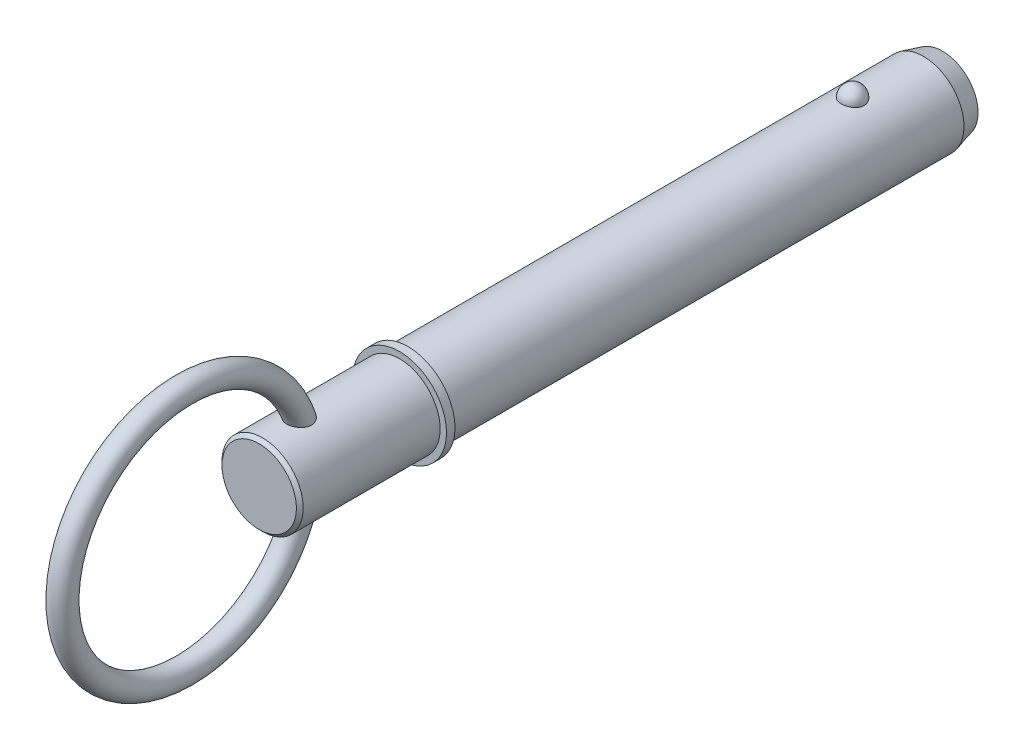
ISO-10303-21;
HEADER;
FILE_DESCRIPTION(('STEP AP214'),'2;1');
FILE_NAME('part.step','',(''),(''),'','','');
FILE_SCHEMA(('AUTOMOTIVE_DESIGN { 1 0 10303 214 1 1 1 1 }'));
ENDSEC;
DATA;
#1=APPLICATION_CONTEXT('core data for automotive mechanical design processes');
#2=APPLICATION_PROTOCOL_DEFINITION('international standard','automotive_design',2000,#1);
#3=PRODUCT_CONTEXT('',#1,'mechanical');
#4=PRODUCT('Part','Part','',(#3));
#5=PRODUCT_RELATED_PRODUCT_CATEGORY('part','',(#4));
#6=PRODUCT_DEFINITION_FORMATION('','',#4);
#7=PRODUCT_DEFINITION_CONTEXT('part definition',#1,'design');
#8=PRODUCT_DEFINITION('design','',#6,#7);
#9=PRODUCT_DEFINITION_SHAPE('','',#8);
#10=(LENGTH_UNIT() NAMED_UNIT(*) SI_UNIT(.MILLI.,.METRE.));
#11=(NAMED_UNIT(*) PLANE_ANGLE_UNIT() SI_UNIT($,.RADIAN.));
#12=(NAMED_UNIT(*) SI_UNIT($,.STERADIAN.) SOLID_ANGLE_UNIT());
#13=UNCERTAINTY_MEASURE_WITH_UNIT(LENGTH_MEASURE(1.E-05),#10,'distance_accuracy_value','');
#14=(GEOMETRIC_REPRESENTATION_CONTEXT(3) GLOBAL_UNCERTAINTY_ASSIGNED_CONTEXT((#13)) GLOBAL_UNIT_ASSIGNED_CONTEXT((#10,
#11,#12)) REPRESENTATION_CONTEXT('',''));
#15=CARTESIAN_POINT('',(0.,0.,0.));
#16=DIRECTION('',(0.,0.,1.));
#17=DIRECTION('',(1.,0.,0.));
#18=AXIS2_PLACEMENT_3D('',#15,#16,#17);
#19=CARTESIAN_POINT('',(0.,0.,101.6));
#20=DIRECTION('',(0.,0.,-1.));
#21=DIRECTION('',(-1.,0.,0.));
#22=AXIS2_PLACEMENT_3D('',#19,#20,#21);
#23=CYLINDRICAL_SURFACE('',#22,9.525);
#24=CARTESIAN_POINT('',(2.66304631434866,9.14515223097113,-2.69));
#25=CARTESIAN_POINT('',(2.66304388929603,9.14515434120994,-2.53964785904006));
#26=CARTESIAN_POINT('',(2.65079171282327,9.14874785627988,-2.389265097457));
#27=CARTESIAN_POINT('',(2.60207590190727,9.16272073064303,-2.09276319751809));
#28=CARTESIAN_POINT('',(2.5656035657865,9.17310252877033,-1.94664561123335));
#29=CARTESIAN_POINT('',(2.469373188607,9.19947238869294,-1.66290124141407));
#30=CARTESIAN_POINT('',(2.40962536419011,9.215457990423,-1.52527076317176));
#31=CARTESIAN_POINT('',(2.26832639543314,9.25124900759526,-1.26225231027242));
#32=CARTESIAN_POINT('',(2.1867756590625,9.27105435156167,-1.13686410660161));
#33=CARTESIAN_POINT('',(2.00344089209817,9.3123948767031,-0.901158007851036));
#34=CARTESIAN_POINT('',(1.90155748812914,9.33393823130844,-0.790918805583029));
#35=CARTESIAN_POINT('',(1.68043702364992,9.37626794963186,-0.589299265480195));
#36=CARTESIAN_POINT('',(1.56119995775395,9.397054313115,-0.497918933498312));
#37=CARTESIAN_POINT('',(1.30893044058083,9.43549335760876,-0.336812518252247));
#38=CARTESIAN_POINT('',(1.17593917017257,9.45315498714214,-0.26702415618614));
#39=CARTESIAN_POINT('',(0.8995966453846,9.48344056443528,-0.150749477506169));
#40=CARTESIAN_POINT('',(0.756246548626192,9.49606507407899,-0.104260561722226));
#41=CARTESIAN_POINT('',(0.466048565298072,9.51468193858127,-0.036573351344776));
#42=CARTESIAN_POINT('',(0.319312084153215,9.52079100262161,-0.0149294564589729));
#43=CARTESIAN_POINT('',(0.0241592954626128,9.52611235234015,0.00395337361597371));
#44=CARTESIAN_POINT('',(-0.124256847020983,9.5253253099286,0.0011946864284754));
#45=CARTESIAN_POINT('',(-0.41628168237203,9.51700443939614,-0.0284230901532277));
#46=CARTESIAN_POINT('',(-0.559928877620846,9.50956858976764,-0.0549321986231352));
#47=CARTESIAN_POINT('',(-0.840604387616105,9.48887888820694,-0.130816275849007));
#48=CARTESIAN_POINT('',(-0.977632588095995,9.47562493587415,-0.180191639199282));
#49=CARTESIAN_POINT('',(-1.24212223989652,9.44460733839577,-0.300803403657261));
#50=CARTESIAN_POINT('',(-1.36952298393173,9.42681774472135,-0.372166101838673));
#51=CARTESIAN_POINT('',(-1.61053183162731,9.38864858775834,-0.534729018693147));
#52=CARTESIAN_POINT('',(-1.72413851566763,9.36826875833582,-0.625931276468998));
#53=CARTESIAN_POINT('',(-1.9367483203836,9.32666137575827,-0.827716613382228));
#54=CARTESIAN_POINT('',(-2.03542624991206,9.3054250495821,-0.938640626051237));
#55=CARTESIAN_POINT('',(-2.21301001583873,9.26480083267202,-1.17562728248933));
#56=CARTESIAN_POINT('',(-2.29191442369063,9.24541307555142,-1.30169101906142));
#57=CARTESIAN_POINT('',(-2.4288038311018,9.21040769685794,-1.56709947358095));
#58=CARTESIAN_POINT('',(-2.48653332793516,9.19483682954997,-1.70658229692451));
#59=CARTESIAN_POINT('',(-2.57830950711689,9.16952722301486,-1.99363485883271));
#60=CARTESIAN_POINT('',(-2.61235688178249,9.1597883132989,-2.14120436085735));
#61=CARTESIAN_POINT('',(-2.65582131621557,9.14728131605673,-2.43957517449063));
#62=CARTESIAN_POINT('',(-2.66534248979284,9.14448376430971,-2.59036007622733));
#63=CARTESIAN_POINT('',(-2.659816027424,9.1460926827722,-2.89143694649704));
#64=CARTESIAN_POINT('',(-2.64476907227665,9.15049895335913,-3.04172892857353));
#65=CARTESIAN_POINT('',(-2.59062526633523,9.16597303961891,-3.33676161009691));
#66=CARTESIAN_POINT('',(-2.55165119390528,9.17700684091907,-3.48152666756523));
#67=CARTESIAN_POINT('',(-2.45072334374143,9.20447158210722,-3.76226728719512));
#68=CARTESIAN_POINT('',(-2.38876863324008,9.22090274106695,-3.89824249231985));
#69=CARTESIAN_POINT('',(-2.24300082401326,9.25744165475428,-4.15838266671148));
#70=CARTESIAN_POINT('',(-2.15906901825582,9.27756919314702,-4.28247834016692));
#71=CARTESIAN_POINT('',(-1.97161008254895,9.31920445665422,-4.51460755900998));
#72=CARTESIAN_POINT('',(-1.86808218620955,9.34071223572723,-4.62264047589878));
#73=CARTESIAN_POINT('',(-1.64365852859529,9.38280712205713,-4.8200541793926));
#74=CARTESIAN_POINT('',(-1.52269814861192,9.40339041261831,-4.90936239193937));
#75=CARTESIAN_POINT('',(-1.26696810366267,9.44124442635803,-5.06628635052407));
#76=CARTESIAN_POINT('',(-1.13219941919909,9.45851538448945,-5.13390363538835));
#77=CARTESIAN_POINT('',(-0.854427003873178,9.48761400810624,-5.24478918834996));
#78=CARTESIAN_POINT('',(-0.711548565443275,9.49950757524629,-5.28835378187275));
#79=CARTESIAN_POINT('',(-0.420167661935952,9.51684639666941,-5.35116010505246));
#80=CARTESIAN_POINT('',(-0.271665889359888,9.52229244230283,-5.37040481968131));
#81=CARTESIAN_POINT('',(0.0236961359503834,9.52609381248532,-5.38387805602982));
#82=CARTESIAN_POINT('',(0.170533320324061,9.52458300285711,-5.37857884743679));
#83=CARTESIAN_POINT('',(0.461166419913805,9.51494050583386,-5.34419624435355));
#84=CARTESIAN_POINT('',(0.604962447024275,9.50680906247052,-5.31511372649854));
#85=CARTESIAN_POINT('',(0.884899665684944,9.48484202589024,-5.23415185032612));
#86=CARTESIAN_POINT('',(1.02106863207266,9.47102889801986,-5.18236222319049));
#87=CARTESIAN_POINT('',(1.28268503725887,9.43915933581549,-5.05742910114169));
#88=CARTESIAN_POINT('',(1.40813178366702,9.421102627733,-4.98428422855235));
#89=CARTESIAN_POINT('',(1.64690915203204,9.38233399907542,-4.81729201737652));
#90=CARTESIAN_POINT('',(1.76002050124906,9.36158508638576,-4.72313982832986));
#91=CARTESIAN_POINT('',(1.96897358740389,9.31987907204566,-4.5173244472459));
#92=CARTESIAN_POINT('',(2.06481234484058,9.29892193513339,-4.40565824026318));
#93=CARTESIAN_POINT('',(2.23837433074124,9.25869342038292,-4.16566572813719));
#94=CARTESIAN_POINT('',(2.31574652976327,9.23945848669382,-4.03707931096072));
#95=CARTESIAN_POINT('',(2.44818540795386,9.20525491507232,-3.76840633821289));
#96=CARTESIAN_POINT('',(2.50325979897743,9.19028480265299,-3.62832377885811));
#97=CARTESIAN_POINT('',(2.58510224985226,9.16757716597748,-3.35610038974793));
#98=CARTESIAN_POINT('',(2.61427951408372,9.15923447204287,-3.22472833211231));
#99=CARTESIAN_POINT('',(2.6532524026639,9.14802112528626,-2.95891229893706));
#100=CARTESIAN_POINT('',(2.66304848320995,9.1451503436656,-2.82446839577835));
#101=CARTESIAN_POINT('',(2.66304631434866,9.14515223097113,-2.69));
#102=B_SPLINE_CURVE_WITH_KNOTS('',3,(#24,#25,#26,#27,#28,#29,#30,#31,#32,#33,#34,#35,#36,#37,
#38,#39,#40,#41,#42,#43,#44,#45,#46,#47,#48,#49,#50,#51,#52,#53,#54,#55,#56,#57,#58,#59,#60,#61,
#62,#63,#64,#65,#66,#67,#68,#69,#70,#71,#72,#73,#74,#75,#76,#77,#78,#79,#80,#81,#82,#83,#84,#85,
#86,#87,#88,#89,#90,#91,#92,#93,#94,#95,#96,#97,#98,#99,#100,#101),.UNSPECIFIED.,.T.,.F.,(4,2,2,
2,2,2,2,2,2,2,2,2,2,2,2,2,2,2,2,2,2,2,2,2,2,2,2,2,2,2,2,2,2,2,2,2,2,2,4),(0.,0.450573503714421,
0.901308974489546,1.35184682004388,1.80237623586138,2.25516399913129,2.70795190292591,
3.15942136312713,3.61084044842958,4.0540301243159,4.49717661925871,4.9338984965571,
5.37062791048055,5.80991423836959,6.24924573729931,6.69708004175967,7.1449466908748,
7.5980522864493,8.0511446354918,8.50231041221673,8.95346368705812,9.40232106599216,
9.85119666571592,10.3025487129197,10.7539184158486,11.2070064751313,11.6600623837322,
12.1074045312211,12.5546917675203,12.9934085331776,13.4321091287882,13.8690915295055,
14.3061021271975,14.7499227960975,15.1938199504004,15.6455814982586,16.0971866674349,
16.5001694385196,16.9031427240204),.UNSPECIFIED.);
#103=CARTESIAN_POINT('',(2.66304631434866,9.14515223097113,-2.69));
#104=VERTEX_POINT('',#103);
#105=EDGE_CURVE('E103',#104,#104,#102,.T.);
#106=ORIENTED_EDGE('',*,*,#105,.T.);
#107=EDGE_LOOP('',(#106));
#108=FACE_BOUND('',#107,.T.);
#109=CARTESIAN_POINT('',(0.,0.,-19.2999999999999));
#110=DIRECTION('',(0.,0.,-1.));
#111=DIRECTION('',(-1.,0.,0.));
#112=AXIS2_PLACEMENT_3D('',#109,#110,#111);
#113=CIRCLE('',#112,9.525);
#114=CARTESIAN_POINT('',(-9.525,0.,-19.2999999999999));
#115=VERTEX_POINT('',#114);
#116=EDGE_CURVE('E110',#115,#115,#113,.F.);
#117=ORIENTED_EDGE('',*,*,#116,.T.);
#118=EDGE_LOOP('',(#117));
#119=FACE_BOUND('',#118,.T.);
#120=CARTESIAN_POINT('',(0.,0.,101.6));
#121=DIRECTION('',(0.,0.,1.));
#122=DIRECTION('',(1.,0.,0.));
#123=AXIS2_PLACEMENT_3D('',#120,#121,#122);
#124=CIRCLE('',#123,9.525);
#125=CARTESIAN_POINT('',(9.525,0.,101.6));
#126=VERTEX_POINT('',#125);
#127=EDGE_CURVE('E108',#126,#126,#124,.T.);
#128=ORIENTED_EDGE('',*,*,#127,.F.);
#129=EDGE_LOOP('',(#128));
#130=FACE_BOUND('',#129,.T.);
#131=ADVANCED_FACE('F39',(#108,#119,#130),#23,.T.);
#132=CARTESIAN_POINT('',(0.,0.,-23.8));
#133=DIRECTION('',(0.,0.,-1.));
#134=DIRECTION('',(-1.,0.,0.));
#135=AXIS2_PLACEMENT_3D('',#132,#133,#134);
#136=PLANE('',#135);
#137=CARTESIAN_POINT('',(0.,0.,-23.8));
#138=DIRECTION('',(0.,0.,-1.));
#139=DIRECTION('',(-1.,0.,0.));
#140=AXIS2_PLACEMENT_3D('',#137,#138,#139);
#141=CIRCLE('',#140,8.31922863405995);
#142=CARTESIAN_POINT('',(-8.31922863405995,0.,-23.8));
#143=VERTEX_POINT('',#142);
#144=EDGE_CURVE('E141',#143,#143,#141,.T.);
#145=ORIENTED_EDGE('',*,*,#144,.T.);
#146=EDGE_LOOP('',(#145));
#147=FACE_BOUND('',#146,.T.);
#148=ADVANCED_FACE('F89',(#147),#136,.T.);
#149=CARTESIAN_POINT('',(0.,0.,-23.8));
#150=DIRECTION('',(0.,0.,1.));
#151=DIRECTION('',(1.,0.,0.));
#152=AXIS2_PLACEMENT_3D('',#149,#150,#151);
#153=CONICAL_SURFACE('',#152,8.31922863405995,0.261799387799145);
#154=ORIENTED_EDGE('',*,*,#116,.F.);
#155=EDGE_LOOP('',(#154));
#156=FACE_BOUND('',#155,.T.);
#157=ORIENTED_EDGE('',*,*,#144,.F.);
#158=EDGE_LOOP('',(#157));
#159=FACE_BOUND('',#158,.T.);
#160=ADVANCED_FACE('F95',(#156,#159),#153,.T.);
#161=CARTESIAN_POINT('',(0.,9.525,-2.69));
#162=DIRECTION('',(0.,1.,0.));
#163=DIRECTION('',(0.,0.,1.));
#164=AXIS2_PLACEMENT_3D('',#161,#162,#163);
#165=SPHERICAL_SURFACE('',#164,2.69);
#166=ORIENTED_EDGE('',*,*,#105,.F.);
#167=EDGE_LOOP('',(#166));
#168=FACE_BOUND('',#167,.T.);
#169=ADVANCED_FACE('F113',(#168),#165,.T.);
#170=CARTESIAN_POINT('',(0.,0.,101.6));
#171=DIRECTION('',(0.,0.,-1.));
#172=DIRECTION('',(-1.,0.,0.));
#173=AXIS2_PLACEMENT_3D('',#170,#171,#172);
#174=PLANE('',#173);
#175=ORIENTED_EDGE('',*,*,#127,.T.);
#176=EDGE_LOOP('',(#175));
#177=FACE_BOUND('',#176,.T.);
#178=CARTESIAN_POINT('',(0.,0.,101.6));
#179=DIRECTION('',(0.,0.,-1.));
#180=DIRECTION('',(-1.,0.,0.));
#181=AXIS2_PLACEMENT_3D('',#178,#179,#180);
#182=CIRCLE('',#181,11.);
#183=CARTESIAN_POINT('',(-11.,0.,101.6));
#184=VERTEX_POINT('',#183);
#185=EDGE_CURVE('E109',#184,#184,#182,.T.);
#186=ORIENTED_EDGE('',*,*,#185,.T.);
#187=EDGE_LOOP('',(#186));
#188=FACE_BOUND('',#187,.T.);
#189=ADVANCED_FACE('F117',(#177,#188),#174,.T.);
#190=CARTESIAN_POINT('',(0.,0.,33.7287874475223));
#191=DIRECTION('',(0.,0.,-1.));
#192=DIRECTION('',(-1.,0.,0.));
#193=AXIS2_PLACEMENT_3D('',#190,#191,#192);
#194=CYLINDRICAL_SURFACE('',#193,11.);
#195=CARTESIAN_POINT('',(0.,0.,103.6));
#196=DIRECTION('',(0.,0.,-1.));
#197=DIRECTION('',(-1.,0.,0.));
#198=AXIS2_PLACEMENT_3D('',#195,#196,#197);
#199=CIRCLE('',#198,11.);
#200=CARTESIAN_POINT('',(-11.,0.,103.6));
#201=VERTEX_POINT('',#200);
#202=EDGE_CURVE('E134',#201,#201,#199,.T.);
#203=ORIENTED_EDGE('',*,*,#202,.T.);
#204=EDGE_LOOP('',(#203));
#205=FACE_BOUND('',#204,.T.);
#206=ORIENTED_EDGE('',*,*,#185,.F.);
#207=EDGE_LOOP('',(#206));
#208=FACE_BOUND('',#207,.T.);
#209=ADVANCED_FACE('F121',(#205,#208),#194,.T.);
#210=CARTESIAN_POINT('',(0.,11.,103.6));
#211=DIRECTION('',(0.,0.,1.));
#212=DIRECTION('',(1.,0.,0.));
#213=AXIS2_PLACEMENT_3D('',#210,#211,#212);
#214=PLANE('',#213);
#215=CARTESIAN_POINT('',(0.,0.,103.6));
#216=DIRECTION('',(0.,0.,1.));
#217=DIRECTION('',(1.,0.,0.));
#218=AXIS2_PLACEMENT_3D('',#215,#216,#217);
#219=CIRCLE('',#218,9.525);
#220=CARTESIAN_POINT('',(9.525,0.,103.6));
#221=VERTEX_POINT('',#220);
#222=EDGE_CURVE('E112',#221,#221,#219,.T.);
#223=ORIENTED_EDGE('',*,*,#222,.F.);
#224=EDGE_LOOP('',(#223));
#225=FACE_BOUND('',#224,.T.);
#226=ORIENTED_EDGE('',*,*,#202,.F.);
#227=EDGE_LOOP('',(#226));
#228=FACE_BOUND('',#227,.T.);
#229=ADVANCED_FACE('F86',(#225,#228),#214,.T.);
#230=CARTESIAN_POINT('',(0.,0.,136.53));
#231=DIRECTION('',(0.,0.,-1.));
#232=DIRECTION('',(-1.,0.,0.));
#233=AXIS2_PLACEMENT_3D('',#230,#231,#232);
#234=CYLINDRICAL_SURFACE('',#233,9.525);
#235=CARTESIAN_POINT('',(-1.17255022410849,-9.45255262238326,124.515681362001));
#236=CARTESIAN_POINT('',(-1.03279041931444,-9.46988901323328,124.452058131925));
#237=CARTESIAN_POINT('',(-0.887457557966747,-9.48474288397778,124.400036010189));
#238=CARTESIAN_POINT('',(-0.589790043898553,-9.50789357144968,124.320301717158));
#239=CARTESIAN_POINT('',(-0.437456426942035,-9.51619135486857,124.292585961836));
#240=CARTESIAN_POINT('',(-0.130095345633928,-9.52535230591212,124.262037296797));
#241=CARTESIAN_POINT('',(0.024932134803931,-9.52621542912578,124.259204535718));
#242=CARTESIAN_POINT('',(0.333291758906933,-9.5204161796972,124.278480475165));
#243=CARTESIAN_POINT('',(0.486623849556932,-9.51375357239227,124.300589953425));
#244=CARTESIAN_POINT('',(0.787326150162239,-9.49360162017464,124.369309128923));
#245=CARTESIAN_POINT('',(0.934692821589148,-9.48010828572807,124.415933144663));
#246=CARTESIAN_POINT('',(1.2191706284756,-9.44773819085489,124.532695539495));
#247=CARTESIAN_POINT('',(1.35628163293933,-9.42886136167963,124.602834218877));
#248=CARTESIAN_POINT('',(1.61597534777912,-9.38783836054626,124.764858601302));
#249=CARTESIAN_POINT('',(1.73859309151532,-9.36570037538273,124.856690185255));
#250=CARTESIAN_POINT('',(1.96611924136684,-9.32059424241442,125.059983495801));
#251=CARTESIAN_POINT('',(2.07103000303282,-9.29762620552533,125.171442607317));
#252=CARTESIAN_POINT('',(2.25895856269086,-9.25375378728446,125.409567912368));
#253=CARTESIAN_POINT('',(2.34223089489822,-9.23282741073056,125.536029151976));
#254=CARTESIAN_POINT('',(2.48638570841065,-9.19505802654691,125.801654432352));
#255=CARTESIAN_POINT('',(2.54727152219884,-9.17821441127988,125.940816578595));
#256=CARTESIAN_POINT('',(2.64504150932,-9.15051673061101,126.226450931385));
#257=CARTESIAN_POINT('',(2.68213620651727,-9.13961026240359,126.37284631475));
#258=CARTESIAN_POINT('',(2.73308631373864,-9.1245038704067,126.669935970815));
#259=CARTESIAN_POINT('',(2.74693762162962,-9.12030513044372,126.820630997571));
#260=CARTESIAN_POINT('',(2.75225289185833,-9.11870262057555,127.128204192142));
#261=CARTESIAN_POINT('',(2.742835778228,-9.12156626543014,127.285097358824));
#262=CARTESIAN_POINT('',(2.70120500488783,-9.13397864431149,127.595530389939));
#263=CARTESIAN_POINT('',(2.66898313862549,-9.14352978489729,127.749069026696));
#264=CARTESIAN_POINT('',(2.57915721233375,-9.1692947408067,128.064317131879));
#265=CARTESIAN_POINT('',(2.5193838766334,-9.18606757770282,128.22536274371));
#266=CARTESIAN_POINT('',(2.37615490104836,-9.22415241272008,128.536112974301));
#267=CARTESIAN_POINT('',(2.2926764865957,-9.2454687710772,128.685806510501));
#268=CARTESIAN_POINT('',(2.09570343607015,-9.29218719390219,128.982005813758));
#269=CARTESIAN_POINT('',(1.98029238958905,-9.31778152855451,129.127215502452));
#270=CARTESIAN_POINT('',(1.72523060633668,-9.36835235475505,129.394631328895));
#271=CARTESIAN_POINT('',(1.58560973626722,-9.39332956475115,129.51686542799));
#272=CARTESIAN_POINT('',(1.31999418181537,-9.4338116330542,129.706542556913));
#273=CARTESIAN_POINT('',(1.19849876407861,-9.45016352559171,129.780111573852));
#274=CARTESIAN_POINT('',(0.944726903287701,-9.47889043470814,129.906555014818));
#275=CARTESIAN_POINT('',(0.812460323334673,-9.4912690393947,129.95944811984));
#276=CARTESIAN_POINT('',(0.539385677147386,-9.51070487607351,130.041579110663));
#277=CARTESIAN_POINT('',(0.39852902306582,-9.51772807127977,130.070665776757));
#278=CARTESIAN_POINT('',(0.113692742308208,-9.52538430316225,130.10234627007));
#279=CARTESIAN_POINT('',(-0.030285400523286,-9.52602031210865,130.104952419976));
#280=CARTESIAN_POINT('',(-0.301067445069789,-9.52110324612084,130.084638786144));
#281=CARTESIAN_POINT('',(-0.428091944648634,-9.51619084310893,130.064361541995));
#282=CARTESIAN_POINT('',(-0.676960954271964,-9.50173118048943,130.003770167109));
#283=CARTESIAN_POINT('',(-0.798804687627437,-9.49218322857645,129.963453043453));
#284=CARTESIAN_POINT('',(-1.03743276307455,-9.4691126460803,129.863797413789));
#285=CARTESIAN_POINT('',(-1.15402581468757,-9.45550022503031,129.804026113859));
#286=CARTESIAN_POINT('',(-1.37707059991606,-9.42560278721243,129.668465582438));
#287=CARTESIAN_POINT('',(-1.48351822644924,-9.40931669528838,129.592669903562));
#288=CARTESIAN_POINT('',(-1.70022776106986,-9.37276249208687,129.415206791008));
#289=CARTESIAN_POINT('',(-1.80866644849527,-9.35226352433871,129.311363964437));
#290=CARTESIAN_POINT('',(-2.00947431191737,-9.31118474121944,129.08916467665));
#291=CARTESIAN_POINT('',(-2.10183201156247,-9.29060487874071,128.970797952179));
#292=CARTESIAN_POINT('',(-2.28343646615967,-9.24779116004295,128.701723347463));
#293=CARTESIAN_POINT('',(-2.36963977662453,-9.22584708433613,128.548904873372));
#294=CARTESIAN_POINT('',(-2.51731958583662,-9.18665215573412,128.231108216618));
#295=CARTESIAN_POINT('',(-2.57878214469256,-9.16940395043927,128.066123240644));
#296=CARTESIAN_POINT('',(-2.67771284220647,-9.14102404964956,127.717906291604));
#297=CARTESIAN_POINT('',(-2.71355979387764,-9.13031106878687,127.534171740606));
#298=CARTESIAN_POINT('',(-2.75239325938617,-9.11868499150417,127.162939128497));
#299=CARTESIAN_POINT('',(-2.75540326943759,-9.11776488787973,126.975443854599));
#300=CARTESIAN_POINT('',(-2.72755769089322,-9.12612848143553,126.618233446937));
#301=CARTESIAN_POINT('',(-2.69938579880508,-9.1346036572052,126.448293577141));
#302=CARTESIAN_POINT('',(-2.61282341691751,-9.15973790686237,126.11694195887));
#303=CARTESIAN_POINT('',(-2.5544530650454,-9.17639152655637,125.955524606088));
#304=CARTESIAN_POINT('',(-2.41575064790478,-9.21381352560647,125.662262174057));
#305=CARTESIAN_POINT('',(-2.33810564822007,-9.23402440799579,125.529067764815));
#306=CARTESIAN_POINT('',(-2.1611059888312,-9.27704240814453,125.278436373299));
#307=CARTESIAN_POINT('',(-2.06174995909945,-9.29984968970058,125.16100038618));
#308=CARTESIAN_POINT('',(-1.84046167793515,-9.34620233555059,124.941444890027));
#309=CARTESIAN_POINT('',(-1.71787459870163,-9.36974632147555,124.83998498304));
#310=CARTESIAN_POINT('',(-1.45637301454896,-9.41393415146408,124.660085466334));
#311=CARTESIAN_POINT('',(-1.31745717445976,-9.43457775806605,124.581647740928));
#312=CARTESIAN_POINT('',(-1.17255022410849,-9.45255262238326,124.515681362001));
#313=B_SPLINE_CURVE_WITH_KNOTS('',3,(#235,#236,#237,#238,#239,#240,#241,#242,#243,#244,#245,
#246,#247,#248,#249,#250,#251,#252,#253,#254,#255,#256,#257,#258,#259,#260,#261,#262,#263,#264,
#265,#266,#267,#268,#269,#270,#271,#272,#273,#274,#275,#276,#277,#278,#279,#280,#281,#282,#283,
#284,#285,#286,#287,#288,#289,#290,#291,#292,#293,#294,#295,#296,#297,#298,#299,#300,#301,#302,
#303,#304,#305,#306,#307,#308,#309,#310,#311,#312),.UNSPECIFIED.,.T.,.F.,(4,2,2,2,2,2,2,2,2,2,2,
2,2,2,2,2,2,2,2,2,2,2,2,2,2,2,2,2,2,2,2,2,2,2,2,2,2,2,4),(0.,0.463035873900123,
0.926003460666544,1.38897381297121,1.85195860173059,2.31521411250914,2.77847553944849,
3.24059321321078,3.70264936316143,4.15899535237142,4.61527338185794,5.0674560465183,
5.51971850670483,5.98936669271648,6.45918397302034,6.9748286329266,7.49097038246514,
8.04995658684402,8.60825803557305,9.03545685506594,9.46226879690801,9.89177127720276,
10.3210738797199,10.7054535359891,11.0898906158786,11.4835430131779,11.8773540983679,
12.3302409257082,12.7834496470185,13.311649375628,13.8401462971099,14.3996817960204,
14.9588168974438,15.4733264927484,15.9874934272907,16.4516692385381,16.915874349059,
17.3959238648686,17.8760126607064),.UNSPECIFIED.);
#314=CARTESIAN_POINT('',(-1.17255022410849,-9.45255262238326,124.515681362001));
#315=VERTEX_POINT('',#314);
#316=EDGE_CURVE('E10',#315,#315,#313,.T.);
#317=ORIENTED_EDGE('',*,*,#316,.F.);
#318=EDGE_LOOP('',(#317));
#319=FACE_BOUND('',#318,.T.);
#320=CARTESIAN_POINT('',(-1.17255022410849,9.45255262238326,124.515681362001));
#321=CARTESIAN_POINT('',(-1.31058061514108,9.43543238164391,124.578514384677));
#322=CARTESIAN_POINT('',(-1.44315063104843,9.41589375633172,124.652651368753));
#323=CARTESIAN_POINT('',(-1.69365345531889,9.37407591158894,124.821892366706));
#324=CARTESIAN_POINT('',(-1.81158925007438,9.35179725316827,124.916992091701));
#325=CARTESIAN_POINT('',(-2.02956633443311,9.30692788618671,125.12596768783));
#326=CARTESIAN_POINT('',(-2.12959463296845,9.28433696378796,125.239857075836));
#327=CARTESIAN_POINT('',(-2.30883055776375,9.24139869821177,125.48334578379));
#328=CARTESIAN_POINT('',(-2.38804080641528,9.22105107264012,125.612943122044));
#329=CARTESIAN_POINT('',(-2.52289811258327,9.18506690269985,125.882637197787));
#330=CARTESIAN_POINT('',(-2.57879510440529,9.16938093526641,126.022602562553));
#331=CARTESIAN_POINT('',(-2.66732862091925,9.14402087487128,126.310194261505));
#332=CARTESIAN_POINT('',(-2.6999643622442,9.13434698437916,126.457820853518));
#333=CARTESIAN_POINT('',(-2.74234854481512,9.12171311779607,126.758709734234));
#334=CARTESIAN_POINT('',(-2.75176419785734,9.11885078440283,126.912022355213));
#335=CARTESIAN_POINT('',(-2.74768995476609,9.12007747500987,127.218282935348));
#336=CARTESIAN_POINT('',(-2.73419331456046,9.12416854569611,127.371230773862));
#337=CARTESIAN_POINT('',(-2.6838140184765,9.13911977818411,127.685048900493));
#338=CARTESIAN_POINT('',(-2.64520186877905,9.15047943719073,127.845615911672));
#339=CARTESIAN_POINT('',(-2.54485320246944,9.17889121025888,128.158878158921));
#340=CARTESIAN_POINT('',(-2.48309922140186,9.19594762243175,128.311567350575));
#341=CARTESIAN_POINT('',(-2.33056913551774,9.23584987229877,128.621122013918));
#342=CARTESIAN_POINT('',(-2.23745101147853,9.25911216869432,128.776784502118));
#343=CARTESIAN_POINT('',(-2.02674425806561,9.307501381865,129.070279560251));
#344=CARTESIAN_POINT('',(-1.90916388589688,9.33262766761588,129.208118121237));
#345=CARTESIAN_POINT('',(-1.67044606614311,9.37804498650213,129.442015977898));
#346=CARTESIAN_POINT('',(-1.55243875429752,9.39849934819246,129.541240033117));
#347=CARTESIAN_POINT('',(-1.30125310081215,9.43654625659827,129.719193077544));
#348=CARTESIAN_POINT('',(-1.16808326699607,9.45414039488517,129.797933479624));
#349=CARTESIAN_POINT('',(-0.958516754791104,9.47691412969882,129.897606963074));
#350=CARTESIAN_POINT('',(-0.886649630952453,9.48392776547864,129.927860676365));
#351=CARTESIAN_POINT('',(-0.74028189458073,9.49647248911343,129.981484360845));
#352=CARTESIAN_POINT('',(-0.665782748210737,9.50200438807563,130.004858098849));
#353=CARTESIAN_POINT('',(-0.514804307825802,9.51137811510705,130.0442294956));
#354=CARTESIAN_POINT('',(-0.438326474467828,9.51522115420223,130.060232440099));
#355=CARTESIAN_POINT('',(-0.284116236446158,9.52107513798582,130.084532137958));
#356=CARTESIAN_POINT('',(-0.206384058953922,9.52308641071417,130.092830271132));
#357=CARTESIAN_POINT('',(0.00463957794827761,9.5259225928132,130.10454519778));
#358=CARTESIAN_POINT('',(0.138460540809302,9.52491109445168,130.100394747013));
#359=CARTESIAN_POINT('',(0.403152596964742,9.51738801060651,130.069251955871));
#360=CARTESIAN_POINT('',(0.534023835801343,9.51087669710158,130.042260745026));
#361=CARTESIAN_POINT('',(0.783985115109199,9.49347484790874,129.968806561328));
#362=CARTESIAN_POINT('',(0.903337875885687,9.48277338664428,129.923181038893));
#363=CARTESIAN_POINT('',(1.1336366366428,9.45800893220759,129.814928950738));
#364=CARTESIAN_POINT('',(1.24458027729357,9.44394500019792,129.752297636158));
#365=CARTESIAN_POINT('',(1.46880911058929,9.41182796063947,129.604389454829));
#366=CARTESIAN_POINT('',(1.58087386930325,9.3935013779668,129.517328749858));
#367=CARTESIAN_POINT('',(1.79132420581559,9.35565274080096,129.328247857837));
#368=CARTESIAN_POINT('',(1.88970126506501,9.33612995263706,129.226218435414));
#369=CARTESIAN_POINT('',(2.08778125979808,9.29401761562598,128.990997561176));
#370=CARTESIAN_POINT('',(2.18473298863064,9.27148591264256,128.85547341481));
#371=CARTESIAN_POINT('',(2.35733954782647,9.22911075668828,128.571030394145));
#372=CARTESIAN_POINT('',(2.43297838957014,9.20926932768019,128.422101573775));
#373=CARTESIAN_POINT('',(2.56843139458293,9.17247322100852,128.097269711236));
#374=CARTESIAN_POINT('',(2.6256192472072,9.15606955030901,127.920196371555));
#375=CARTESIAN_POINT('',(2.70930664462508,9.13166037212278,127.558330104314));
#376=CARTESIAN_POINT('',(2.73581406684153,9.12365270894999,127.373539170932));
#377=CARTESIAN_POINT('',(2.7551261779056,9.11784049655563,127.009017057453));
#378=CARTESIAN_POINT('',(2.74917791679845,9.11965839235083,126.829361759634));
#379=CARTESIAN_POINT('',(2.70473277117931,9.13294027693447,126.474499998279));
#380=CARTESIAN_POINT('',(2.66626406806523,9.14439591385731,126.299289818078));
#381=CARTESIAN_POINT('',(2.56263844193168,9.17393184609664,125.978469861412));
#382=CARTESIAN_POINT('',(2.50080069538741,9.19116614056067,125.831704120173));
#383=CARTESIAN_POINT('',(2.35244847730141,9.23024728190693,125.55189992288));
#384=CARTESIAN_POINT('',(2.26593972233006,9.25209305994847,125.418858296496));
#385=CARTESIAN_POINT('',(2.07585352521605,9.29652853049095,125.177145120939));
#386=CARTESIAN_POINT('',(1.97340753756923,9.31901931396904,125.067562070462));
#387=CARTESIAN_POINT('',(1.75142335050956,9.36327537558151,124.867179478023));
#388=CARTESIAN_POINT('',(1.63188535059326,9.38504066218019,124.776379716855));
#389=CARTESIAN_POINT('',(1.37826267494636,9.42563474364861,124.615168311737));
#390=CARTESIAN_POINT('',(1.24409194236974,9.44444438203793,124.544887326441));
#391=CARTESIAN_POINT('',(0.965562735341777,9.47697010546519,124.426996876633));
#392=CARTESIAN_POINT('',(0.821203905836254,9.4906860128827,124.379388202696));
#393=CARTESIAN_POINT('',(0.524366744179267,9.51173338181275,124.307369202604));
#394=CARTESIAN_POINT('',(0.371807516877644,9.5189799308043,124.283267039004));
#395=CARTESIAN_POINT('',(0.0646112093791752,9.52602042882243,124.259842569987));
#396=CARTESIAN_POINT('',(-0.0900262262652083,9.52581308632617,124.260524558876));
#397=CARTESIAN_POINT('',(-0.404139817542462,9.51777767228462,124.287276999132));
#398=CARTESIAN_POINT('',(-0.563508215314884,9.50959696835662,124.31452226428));
#399=CARTESIAN_POINT('',(-0.874799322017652,9.48602809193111,124.395533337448));
#400=CARTESIAN_POINT('',(-1.02672214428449,9.47064002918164,124.44929874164));
#401=CARTESIAN_POINT('',(-1.17255022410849,9.45255262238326,124.515681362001));
#402=B_SPLINE_CURVE_WITH_KNOTS('',3,(#320,#321,#322,#323,#324,#325,#326,#327,#328,#329,#330,
#331,#332,#333,#334,#335,#336,#337,#338,#339,#340,#341,#342,#343,#344,#345,#346,#347,#348,#349,
#350,#351,#352,#353,#354,#355,#356,#357,#358,#359,#360,#361,#362,#363,#364,#365,#366,#367,#368,
#369,#370,#371,#372,#373,#374,#375,#376,#377,#378,#379,#380,#381,#382,#383,#384,#385,#386,#387,
#388,#389,#390,#391,#392,#393,#394,#395,#396,#397,#398,#399,#400,#401),.UNSPECIFIED.,.T.,.F.,(4,
2,2,2,2,2,2,2,2,2,2,2,2,2,2,2,2,2,2,2,2,2,2,2,2,2,2,2,2,2,2,2,2,2,2,2,2,2,2,2,4),(0.,
0.457306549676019,0.914519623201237,1.37206305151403,1.82954881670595,2.28199545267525,
2.73445732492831,3.19336710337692,3.6524119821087,4.14699278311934,4.64194758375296,
5.18812269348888,5.73411374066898,6.19889752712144,6.66342179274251,6.89799214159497,
7.13243382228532,7.36670711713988,7.60093844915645,8.00032434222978,8.39969048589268,
8.78279802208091,9.16601265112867,9.59366701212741,10.0215863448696,10.5240084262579,
11.0268064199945,11.5844522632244,12.1419548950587,12.6781910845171,13.213963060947,
13.6920531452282,14.1700325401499,14.6229745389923,15.0759112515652,15.5316722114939,
15.9874490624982,16.4491237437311,16.9108784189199,17.3940267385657,17.8771677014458),.UNSPECIFIED.);
#403=CARTESIAN_POINT('',(-1.17255022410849,9.45255262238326,124.515681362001));
#404=VERTEX_POINT('',#403);
#405=EDGE_CURVE('E51',#404,#404,#402,.T.);
#406=ORIENTED_EDGE('',*,*,#405,.F.);
#407=EDGE_LOOP('',(#406));
#408=FACE_BOUND('',#407,.T.);
#409=CARTESIAN_POINT('',(0.,0.,135.73));
#410=DIRECTION('',(0.,0.,-1.));
#411=DIRECTION('',(-1.,0.,0.));
#412=AXIS2_PLACEMENT_3D('',#409,#410,#411);
#413=CIRCLE('',#412,9.525);
#414=CARTESIAN_POINT('',(-9.525,0.,135.73));
#415=VERTEX_POINT('',#414);
#416=EDGE_CURVE('E65',#415,#415,#413,.T.);
#417=ORIENTED_EDGE('',*,*,#416,.T.);
#418=EDGE_LOOP('',(#417));
#419=FACE_BOUND('',#418,.T.);
#420=ORIENTED_EDGE('',*,*,#222,.T.);
#421=EDGE_LOOP('',(#420));
#422=FACE_BOUND('',#421,.T.);
#423=ADVANCED_FACE('F70',(#319,#408,#419,#422),#234,.T.);
#424=CARTESIAN_POINT('',(0.,0.,136.53));
#425=DIRECTION('',(0.,0.,-1.));
#426=DIRECTION('',(-1.,0.,0.));
#427=AXIS2_PLACEMENT_3D('',#424,#425,#426);
#428=PLANE('',#427);
#429=CARTESIAN_POINT('',(0.,0.,136.53));
#430=DIRECTION('',(0.,0.,-1.));
#431=DIRECTION('',(-1.,0.,0.));
#432=AXIS2_PLACEMENT_3D('',#429,#430,#431);
#433=CIRCLE('',#432,8.72500000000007);
#434=CARTESIAN_POINT('',(-8.72500000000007,0.,136.53));
#435=VERTEX_POINT('',#434);
#436=EDGE_CURVE('E58',#435,#435,#433,.F.);
#437=ORIENTED_EDGE('',*,*,#436,.T.);
#438=EDGE_LOOP('',(#437));
#439=FACE_BOUND('',#438,.T.);
#440=ADVANCED_FACE('F77',(#439),#428,.F.);
#441=CARTESIAN_POINT('',(0.,0.,135.73));
#442=DIRECTION('',(0.,0.,-1.));
#443=DIRECTION('',(-1.,0.,0.));
#444=AXIS2_PLACEMENT_3D('',#441,#442,#443);
#445=CONICAL_SURFACE('',#444,9.525,0.785398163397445);
#446=ORIENTED_EDGE('',*,*,#436,.F.);
#447=EDGE_LOOP('',(#446));
#448=FACE_BOUND('',#447,.T.);
#449=ORIENTED_EDGE('',*,*,#416,.F.);
#450=EDGE_LOOP('',(#449));
#451=FACE_BOUND('',#450,.T.);
#452=ADVANCED_FACE('F41',(#448,#451),#445,.T.);
#453=CARTESIAN_POINT('',(0.,0.,154.105));
#454=DIRECTION('',(1.,0.,0.));
#455=DIRECTION('',(0.,0.,-1.));
#456=AXIS2_PLACEMENT_3D('',#453,#454,#455);
#457=TOROIDAL_SURFACE('',#456,28.575,2.75);
#458=ORIENTED_EDGE('',*,*,#316,.T.);
#459=EDGE_LOOP('',(#458));
#460=FACE_BOUND('',#459,.T.);
#461=ORIENTED_EDGE('',*,*,#405,.T.);
#462=EDGE_LOOP('',(#461));
#463=FACE_BOUND('',#462,.T.);
#464=ADVANCED_FACE('F74',(#460,#463),#457,.T.);
#465=CLOSED_SHELL('',(#131,#148,#160,#169,#189,#209,#229,#423,#440,#452,#464));
#466=MANIFOLD_SOLID_BREP('B2',#465);
#467=ADVANCED_BREP_SHAPE_REPRESENTATION('',(#18,#466),#14);
#468=SHAPE_DEFINITION_REPRESENTATION(#9,#467);
ENDSEC;
END-ISO-10303-21;
